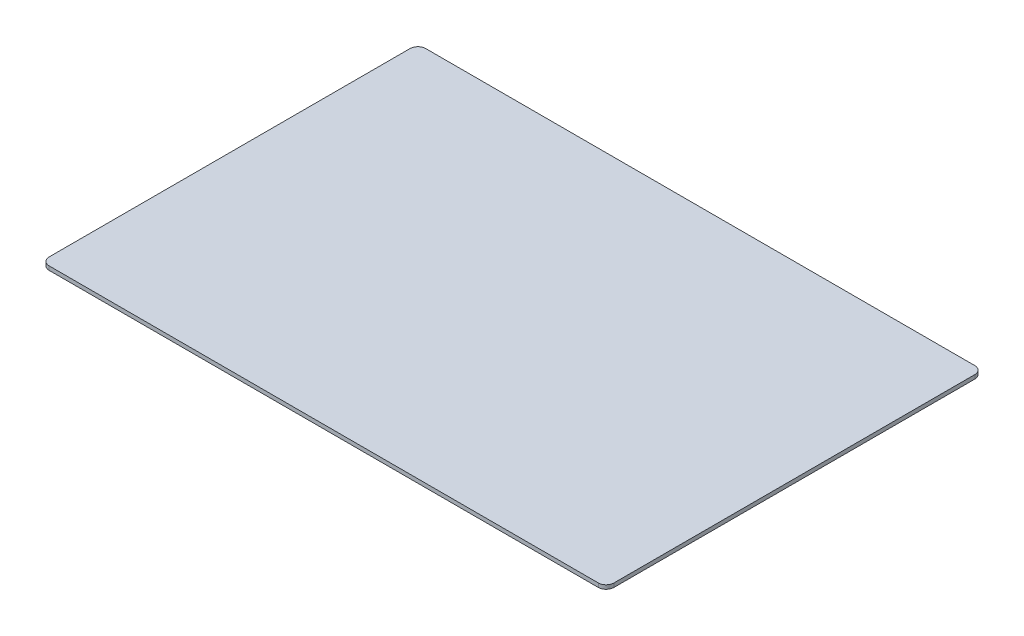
from build123d import *

# Parameters (mm, degrees)
SKETCH1_W           = 457.2
SKETCH1_H           = 304.8
BOSS_EXTRUDE1_DEPTH = 3.175
FILLET1_R           = 6.35


with BuildPart() as part:
    # Sketch1 → Boss-Extrude1 (new body)
    with BuildSketch(Plane(origin=(0, 0, 0), x_dir=(1, 0, 0), z_dir=(0, 1, 0))):
        Rectangle(SKETCH1_W, SKETCH1_H)
    extrude(amount=BOSS_EXTRUDE1_DEPTH)

    # Fillet1
    fillet1_edges = [part.edges().sort_by_distance(p)[0] for p in [
        (228.6, 1.5875, 152.4),
        (-228.6, 1.5875, 152.4),
        (-228.6, 1.5875, -152.4),
        (228.6, 1.5875, -152.4),
    ]]
    fillet(fillet1_edges, radius=FILLET1_R)


solid = part.part
